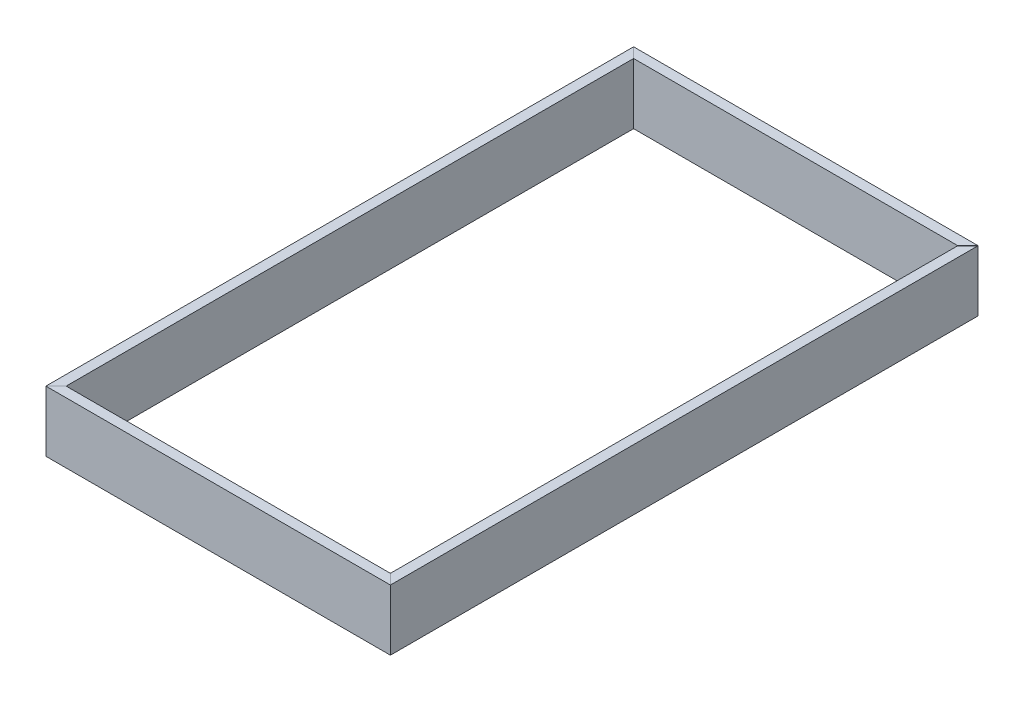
ISO-10303-21;
HEADER;
FILE_DESCRIPTION(('STEP AP214'),'2;1');
FILE_NAME('part.step','',(''),(''),'','','');
FILE_SCHEMA(('AUTOMOTIVE_DESIGN { 1 0 10303 214 1 1 1 1 }'));
ENDSEC;
DATA;
#1=APPLICATION_CONTEXT('core data for automotive mechanical design processes');
#2=APPLICATION_PROTOCOL_DEFINITION('international standard','automotive_design',2000,#1);
#3=PRODUCT_CONTEXT('',#1,'mechanical');
#4=PRODUCT('Part','Part','',(#3));
#5=PRODUCT_RELATED_PRODUCT_CATEGORY('part','',(#4));
#6=PRODUCT_DEFINITION_FORMATION('','',#4);
#7=PRODUCT_DEFINITION_CONTEXT('part definition',#1,'design');
#8=PRODUCT_DEFINITION('design','',#6,#7);
#9=PRODUCT_DEFINITION_SHAPE('','',#8);
#10=(LENGTH_UNIT() NAMED_UNIT(*) SI_UNIT(.MILLI.,.METRE.));
#11=(NAMED_UNIT(*) PLANE_ANGLE_UNIT() SI_UNIT($,.RADIAN.));
#12=(NAMED_UNIT(*) SI_UNIT($,.STERADIAN.) SOLID_ANGLE_UNIT());
#13=UNCERTAINTY_MEASURE_WITH_UNIT(LENGTH_MEASURE(1.E-05),#10,'distance_accuracy_value','');
#14=(GEOMETRIC_REPRESENTATION_CONTEXT(3) GLOBAL_UNCERTAINTY_ASSIGNED_CONTEXT((#13)) GLOBAL_UNIT_ASSIGNED_CONTEXT((#10,
#11,#12)) REPRESENTATION_CONTEXT('',''));
#15=CARTESIAN_POINT('',(0.,0.,0.));
#16=DIRECTION('',(0.,0.,1.));
#17=DIRECTION('',(1.,0.,0.));
#18=AXIS2_PLACEMENT_3D('',#15,#16,#17);
#19=CARTESIAN_POINT('',(0.,0.,88.9));
#20=DIRECTION('',(0.,-1.,0.));
#21=DIRECTION('',(0.,0.,-1.));
#22=AXIS2_PLACEMENT_3D('',#19,#20,#21);
#23=PLANE('',#22);
#24=DIRECTION('',(0.,0.,-1.));
#25=VECTOR('',#24,1.);
#26=CARTESIAN_POINT('',(15.875,0.,-92.075));
#27=LINE('',#26,#25);
#28=CARTESIAN_POINT('',(15.875,0.,92.0390789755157));
#29=VERTEX_POINT('',#28);
#30=CARTESIAN_POINT('',(15.875,0.,-92.0390789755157));
#31=VERTEX_POINT('',#30);
#32=EDGE_CURVE('E108',#29,#31,#27,.T.);
#33=ORIENTED_EDGE('',*,*,#32,.F.);
#34=DIRECTION('',(-0.707106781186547,0.,0.707106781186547));
#35=VECTOR('',#34,1.);
#36=CARTESIAN_POINT('',(19.0320394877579,0.,88.8820394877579));
#37=LINE('',#36,#35);
#38=CARTESIAN_POINT('',(19.05,0.,88.8640789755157));
#39=VERTEX_POINT('',#38);
#40=EDGE_CURVE('E12',#39,#29,#37,.T.);
#41=ORIENTED_EDGE('',*,*,#40,.F.);
#42=DIRECTION('',(0.,0.,-1.));
#43=VECTOR('',#42,1.);
#44=CARTESIAN_POINT('',(19.05,0.,88.9));
#45=LINE('',#44,#43);
#46=CARTESIAN_POINT('',(19.05,0.,-88.8640789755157));
#47=VERTEX_POINT('',#46);
#48=EDGE_CURVE('E93',#39,#47,#45,.T.);
#49=ORIENTED_EDGE('',*,*,#48,.T.);
#50=DIRECTION('',(0.707106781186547,0.,0.707106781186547));
#51=VECTOR('',#50,1.);
#52=CARTESIAN_POINT('',(19.0320394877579,0.,-88.8820394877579));
#53=LINE('',#52,#51);
#54=EDGE_CURVE('E51',#31,#47,#53,.T.);
#55=ORIENTED_EDGE('',*,*,#54,.F.);
#56=EDGE_LOOP('',(#33,#41,#49,#55));
#57=FACE_BOUND('',#56,.T.);
#58=ADVANCED_FACE('F43',(#57),#23,.F.);
#59=CARTESIAN_POINT('',(19.0320394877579,-19.050025,-88.8820394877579));
#60=DIRECTION('',(-0.707106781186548,0.,0.707106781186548));
#61=DIRECTION('',(0.707106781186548,0.,0.707106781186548));
#62=AXIS2_PLACEMENT_3D('',#59,#60,#61);
#63=PLANE('',#62);
#64=DIRECTION('',(0.,-1.,0.));
#65=VECTOR('',#64,1.);
#66=CARTESIAN_POINT('',(15.875,-3.175,-92.0390789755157));
#67=LINE('',#66,#65);
#68=CARTESIAN_POINT('',(15.875,-19.05,-92.0390789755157));
#69=VERTEX_POINT('',#68);
#70=EDGE_CURVE('E87',#31,#69,#67,.T.);
#71=ORIENTED_EDGE('',*,*,#70,.F.);
#72=ORIENTED_EDGE('',*,*,#54,.T.);
#73=DIRECTION('',(0.,1.,0.));
#74=VECTOR('',#73,1.);
#75=CARTESIAN_POINT('',(19.05,0.,-88.8640789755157));
#76=LINE('',#75,#74);
#77=CARTESIAN_POINT('',(19.05,-19.05,-88.8640789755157));
#78=VERTEX_POINT('',#77);
#79=EDGE_CURVE('E84',#78,#47,#76,.T.);
#80=ORIENTED_EDGE('',*,*,#79,.F.);
#81=DIRECTION('',(0.707106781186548,0.,0.707106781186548));
#82=VECTOR('',#81,1.);
#83=CARTESIAN_POINT('',(106.344539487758,-19.05,-1.56953948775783));
#84=LINE('',#83,#82);
#85=EDGE_CURVE('E96',#69,#78,#84,.T.);
#86=ORIENTED_EDGE('',*,*,#85,.F.);
#87=EDGE_LOOP('',(#71,#72,#80,#86));
#88=FACE_BOUND('',#87,.T.);
#89=ADVANCED_FACE('F81',(#88),#63,.F.);
#90=CARTESIAN_POINT('',(19.0320394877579,-19.050025,88.8820394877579));
#91=DIRECTION('',(-0.707106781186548,0.,-0.707106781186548));
#92=DIRECTION('',(-0.707106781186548,0.,0.707106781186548));
#93=AXIS2_PLACEMENT_3D('',#90,#91,#92);
#94=PLANE('',#93);
#95=ORIENTED_EDGE('',*,*,#40,.T.);
#96=DIRECTION('',(0.,1.,0.));
#97=VECTOR('',#96,1.);
#98=CARTESIAN_POINT('',(15.875,-3.175,92.0390789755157));
#99=LINE('',#98,#97);
#100=CARTESIAN_POINT('',(15.875,-19.05,92.0390789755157));
#101=VERTEX_POINT('',#100);
#102=EDGE_CURVE('E95',#101,#29,#99,.T.);
#103=ORIENTED_EDGE('',*,*,#102,.F.);
#104=DIRECTION('',(-0.707106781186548,0.,0.707106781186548));
#105=VECTOR('',#104,1.);
#106=CARTESIAN_POINT('',(17.4445394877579,-19.05,90.4695394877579));
#107=LINE('',#106,#105);
#108=CARTESIAN_POINT('',(19.05,-19.05,88.8640789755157));
#109=VERTEX_POINT('',#108);
#110=EDGE_CURVE('E63',#109,#101,#107,.T.);
#111=ORIENTED_EDGE('',*,*,#110,.F.);
#112=DIRECTION('',(0.,-1.,0.));
#113=VECTOR('',#112,1.);
#114=CARTESIAN_POINT('',(19.05,0.,88.8640789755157));
#115=LINE('',#114,#113);
#116=EDGE_CURVE('E57',#39,#109,#115,.T.);
#117=ORIENTED_EDGE('',*,*,#116,.F.);
#118=EDGE_LOOP('',(#95,#103,#111,#117));
#119=FACE_BOUND('',#118,.T.);
#120=ADVANCED_FACE('F120',(#119),#94,.F.);
#121=CARTESIAN_POINT('',(15.875,-19.05,88.9));
#122=DIRECTION('',(0.,1.,0.));
#123=DIRECTION('',(0.,0.,1.));
#124=AXIS2_PLACEMENT_3D('',#121,#122,#123);
#125=PLANE('',#124);
#126=DIRECTION('',(0.,0.,-1.));
#127=VECTOR('',#126,1.);
#128=CARTESIAN_POINT('',(19.05,-19.05,88.9));
#129=LINE('',#128,#127);
#130=EDGE_CURVE('E100',#109,#78,#129,.T.);
#131=ORIENTED_EDGE('',*,*,#130,.F.);
#132=ORIENTED_EDGE('',*,*,#110,.T.);
#133=DIRECTION('',(0.,0.,-1.));
#134=VECTOR('',#133,1.);
#135=CARTESIAN_POINT('',(15.875,-19.05,88.9));
#136=LINE('',#135,#134);
#137=EDGE_CURVE('E107',#101,#69,#136,.T.);
#138=ORIENTED_EDGE('',*,*,#137,.T.);
#139=ORIENTED_EDGE('',*,*,#85,.T.);
#140=EDGE_LOOP('',(#131,#132,#138,#139));
#141=FACE_BOUND('',#140,.T.);
#142=ADVANCED_FACE('F45',(#141),#125,.F.);
#143=CARTESIAN_POINT('',(15.875,-3.175,88.9));
#144=DIRECTION('',(1.,0.,0.));
#145=DIRECTION('',(0.,0.,-1.));
#146=AXIS2_PLACEMENT_3D('',#143,#144,#145);
#147=PLANE('',#146);
#148=ORIENTED_EDGE('',*,*,#137,.F.);
#149=ORIENTED_EDGE('',*,*,#102,.T.);
#150=ORIENTED_EDGE('',*,*,#32,.T.);
#151=ORIENTED_EDGE('',*,*,#70,.T.);
#152=EDGE_LOOP('',(#148,#149,#150,#151));
#153=FACE_BOUND('',#152,.T.);
#154=ADVANCED_FACE('F117',(#153),#147,.F.);
#155=CARTESIAN_POINT('',(19.05,0.,88.9));
#156=DIRECTION('',(-1.,0.,0.));
#157=DIRECTION('',(0.,0.,1.));
#158=AXIS2_PLACEMENT_3D('',#155,#156,#157);
#159=PLANE('',#158);
#160=ORIENTED_EDGE('',*,*,#48,.F.);
#161=ORIENTED_EDGE('',*,*,#116,.T.);
#162=ORIENTED_EDGE('',*,*,#130,.T.);
#163=ORIENTED_EDGE('',*,*,#79,.T.);
#164=EDGE_LOOP('',(#160,#161,#162,#163));
#165=FACE_BOUND('',#164,.T.);
#166=ADVANCED_FACE('F98',(#165),#159,.F.);
#167=CLOSED_SHELL('',(#58,#89,#120,#142,#154,#166));
#168=MANIFOLD_SOLID_BREP('B2',#167);
#169=CARTESIAN_POINT('',(139.682039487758,-19.050025,107.967960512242));
#170=DIRECTION('',(-0.707106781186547,0.,0.707106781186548));
#171=DIRECTION('',(0.707106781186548,0.,0.707106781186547));
#172=AXIS2_PLACEMENT_3D('',#169,#170,#171);
#173=PLANE('',#172);
#174=DIRECTION('',(0.707106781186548,0.,0.707106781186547));
#175=VECTOR('',#174,1.);
#176=CARTESIAN_POINT('',(139.682039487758,0.,107.967960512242));
#177=LINE('',#176,#175);
#178=CARTESIAN_POINT('',(120.614078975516,0.,88.9));
#179=VERTEX_POINT('',#178);
#180=CARTESIAN_POINT('',(123.789078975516,0.,92.075));
#181=VERTEX_POINT('',#180);
#182=EDGE_CURVE('E219',#179,#181,#177,.T.);
#183=ORIENTED_EDGE('',*,*,#182,.T.);
#184=DIRECTION('',(0.,1.,0.));
#185=VECTOR('',#184,1.);
#186=CARTESIAN_POINT('',(123.789078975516,-127.046681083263,92.075));
#187=LINE('',#186,#185);
#188=CARTESIAN_POINT('',(123.789078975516,-19.05,92.075));
#189=VERTEX_POINT('',#188);
#190=EDGE_CURVE('E247',#189,#181,#187,.T.);
#191=ORIENTED_EDGE('',*,*,#190,.F.);
#192=DIRECTION('',(0.707106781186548,0.,0.707106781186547));
#193=VECTOR('',#192,1.);
#194=CARTESIAN_POINT('',(68.2445394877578,-19.05,36.5304605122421));
#195=LINE('',#194,#193);
#196=CARTESIAN_POINT('',(120.614078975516,-19.05,88.9));
#197=VERTEX_POINT('',#196);
#198=EDGE_CURVE('E269',#197,#189,#195,.T.);
#199=ORIENTED_EDGE('',*,*,#198,.F.);
#200=DIRECTION('',(0.,1.,0.));
#201=VECTOR('',#200,1.);
#202=CARTESIAN_POINT('',(120.614078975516,-144.167881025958,88.9));
#203=LINE('',#202,#201);
#204=EDGE_CURVE('E257',#197,#179,#203,.T.);
#205=ORIENTED_EDGE('',*,*,#204,.T.);
#206=EDGE_LOOP('',(#183,#191,#199,#205));
#207=FACE_BOUND('',#206,.T.);
#208=ADVANCED_FACE('F211',(#207),#173,.F.);
#209=CARTESIAN_POINT('',(0.,0.,88.9));
#210=DIRECTION('',(0.,-1.,0.));
#211=DIRECTION('',(0.,0.,-1.));
#212=AXIS2_PLACEMENT_3D('',#209,#210,#211);
#213=PLANE('',#212);
#214=DIRECTION('',(-1.,0.,0.));
#215=VECTOR('',#214,1.);
#216=CARTESIAN_POINT('',(15.875,0.,92.075));
#217=LINE('',#216,#215);
#218=CARTESIAN_POINT('',(15.9109210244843,0.,92.075));
#219=VERTEX_POINT('',#218);
#220=EDGE_CURVE('E250',#181,#219,#217,.T.);
#221=ORIENTED_EDGE('',*,*,#220,.F.);
#222=ORIENTED_EDGE('',*,*,#182,.F.);
#223=DIRECTION('',(-1.,0.,0.));
#224=VECTOR('',#223,1.);
#225=CARTESIAN_POINT('',(0.,0.,88.9));
#226=LINE('',#225,#224);
#227=CARTESIAN_POINT('',(19.0859210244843,0.,88.9));
#228=VERTEX_POINT('',#227);
#229=EDGE_CURVE('E270',#179,#228,#226,.T.);
#230=ORIENTED_EDGE('',*,*,#229,.T.);
#231=DIRECTION('',(0.707106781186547,0.,-0.707106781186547));
#232=VECTOR('',#231,1.);
#233=CARTESIAN_POINT('',(19.0679605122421,0.,88.9179605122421));
#234=LINE('',#233,#232);
#235=EDGE_CURVE('E264',#219,#228,#234,.T.);
#236=ORIENTED_EDGE('',*,*,#235,.F.);
#237=EDGE_LOOP('',(#221,#222,#230,#236));
#238=FACE_BOUND('',#237,.T.);
#239=ADVANCED_FACE('F261',(#238),#213,.F.);
#240=CARTESIAN_POINT('',(19.0679605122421,-19.050025,88.9179605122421));
#241=DIRECTION('',(0.707106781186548,0.,0.707106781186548));
#242=DIRECTION('',(0.707106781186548,0.,-0.707106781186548));
#243=AXIS2_PLACEMENT_3D('',#240,#241,#242);
#244=PLANE('',#243);
#245=DIRECTION('',(0.,-1.,0.));
#246=VECTOR('',#245,1.);
#247=CARTESIAN_POINT('',(15.9109210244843,-127.046681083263,92.075));
#248=LINE('',#247,#246);
#249=CARTESIAN_POINT('',(15.9109210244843,-19.05,92.075));
#250=VERTEX_POINT('',#249);
#251=EDGE_CURVE('E41',#219,#250,#248,.T.);
#252=ORIENTED_EDGE('',*,*,#251,.F.);
#253=ORIENTED_EDGE('',*,*,#235,.T.);
#254=DIRECTION('',(0.,-1.,0.));
#255=VECTOR('',#254,1.);
#256=CARTESIAN_POINT('',(19.0859210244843,-144.167881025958,88.9));
#257=LINE('',#256,#255);
#258=CARTESIAN_POINT('',(19.0859210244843,-19.05,88.9));
#259=VERTEX_POINT('',#258);
#260=EDGE_CURVE('E271',#228,#259,#257,.T.);
#261=ORIENTED_EDGE('',*,*,#260,.T.);
#262=DIRECTION('',(0.707106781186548,0.,-0.707106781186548));
#263=VECTOR('',#262,1.);
#264=CARTESIAN_POINT('',(17.4804605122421,-19.05,90.5054605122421));
#265=LINE('',#264,#263);
#266=EDGE_CURVE('E229',#250,#259,#265,.T.);
#267=ORIENTED_EDGE('',*,*,#266,.F.);
#268=EDGE_LOOP('',(#252,#253,#261,#267));
#269=FACE_BOUND('',#268,.T.);
#270=ADVANCED_FACE('F281',(#269),#244,.F.);
#271=CARTESIAN_POINT('',(0.,-144.167881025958,88.9));
#272=DIRECTION('',(0.,0.,-1.));
#273=DIRECTION('',(-1.,0.,0.));
#274=AXIS2_PLACEMENT_3D('',#271,#272,#273);
#275=PLANE('',#274);
#276=ORIENTED_EDGE('',*,*,#260,.F.);
#277=ORIENTED_EDGE('',*,*,#229,.F.);
#278=ORIENTED_EDGE('',*,*,#204,.F.);
#279=DIRECTION('',(-1.,0.,0.));
#280=VECTOR('',#279,1.);
#281=CARTESIAN_POINT('',(15.875,-19.05,88.9));
#282=LINE('',#281,#280);
#283=EDGE_CURVE('E274',#197,#259,#282,.T.);
#284=ORIENTED_EDGE('',*,*,#283,.T.);
#285=EDGE_LOOP('',(#276,#277,#278,#284));
#286=FACE_BOUND('',#285,.T.);
#287=ADVANCED_FACE('F283',(#286),#275,.T.);
#288=CARTESIAN_POINT('',(15.875,-127.046681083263,92.075));
#289=DIRECTION('',(0.,0.,-1.));
#290=DIRECTION('',(-1.,0.,0.));
#291=AXIS2_PLACEMENT_3D('',#288,#289,#290);
#292=PLANE('',#291);
#293=ORIENTED_EDGE('',*,*,#190,.T.);
#294=ORIENTED_EDGE('',*,*,#220,.T.);
#295=ORIENTED_EDGE('',*,*,#251,.T.);
#296=DIRECTION('',(1.,0.,0.));
#297=VECTOR('',#296,1.);
#298=CARTESIAN_POINT('',(15.875,-19.05,92.075));
#299=LINE('',#298,#297);
#300=EDGE_CURVE('E253',#250,#189,#299,.T.);
#301=ORIENTED_EDGE('',*,*,#300,.T.);
#302=EDGE_LOOP('',(#293,#294,#295,#301));
#303=FACE_BOUND('',#302,.T.);
#304=ADVANCED_FACE('F249',(#303),#292,.F.);
#305=CARTESIAN_POINT('',(15.875,-19.05,88.9));
#306=DIRECTION('',(0.,1.,0.));
#307=DIRECTION('',(0.,0.,1.));
#308=AXIS2_PLACEMENT_3D('',#305,#306,#307);
#309=PLANE('',#308);
#310=ORIENTED_EDGE('',*,*,#300,.F.);
#311=ORIENTED_EDGE('',*,*,#266,.T.);
#312=ORIENTED_EDGE('',*,*,#283,.F.);
#313=ORIENTED_EDGE('',*,*,#198,.T.);
#314=EDGE_LOOP('',(#310,#311,#312,#313));
#315=FACE_BOUND('',#314,.T.);
#316=ADVANCED_FACE('F213',(#315),#309,.F.);
#317=CLOSED_SHELL('',(#208,#239,#270,#287,#304,#316));
#318=MANIFOLD_SOLID_BREP('B6',#317);
#319=CARTESIAN_POINT('',(120.667960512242,-19.050025,-88.8820394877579));
#320=DIRECTION('',(0.707106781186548,0.,0.707106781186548));
#321=DIRECTION('',(0.707106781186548,0.,-0.707106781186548));
#322=AXIS2_PLACEMENT_3D('',#319,#320,#321);
#323=PLANE('',#322);
#324=DIRECTION('',(0.707106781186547,0.,-0.707106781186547));
#325=VECTOR('',#324,1.);
#326=CARTESIAN_POINT('',(120.667960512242,0.,-88.8820394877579));
#327=LINE('',#326,#325);
#328=CARTESIAN_POINT('',(120.65,0.,-88.8640789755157));
#329=VERTEX_POINT('',#328);
#330=CARTESIAN_POINT('',(123.825,0.,-92.0390789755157));
#331=VERTEX_POINT('',#330);
#332=EDGE_CURVE('E381',#329,#331,#327,.T.);
#333=ORIENTED_EDGE('',*,*,#332,.T.);
#334=DIRECTION('',(0.,1.,0.));
#335=VECTOR('',#334,1.);
#336=CARTESIAN_POINT('',(123.825,-3.1749999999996,-92.0390789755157));
#337=LINE('',#336,#335);
#338=CARTESIAN_POINT('',(123.825,-19.05,-92.0390789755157));
#339=VERTEX_POINT('',#338);
#340=EDGE_CURVE('E409',#339,#331,#337,.T.);
#341=ORIENTED_EDGE('',*,*,#340,.F.);
#342=DIRECTION('',(0.707106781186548,0.,-0.707106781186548));
#343=VECTOR('',#342,1.);
#344=CARTESIAN_POINT('',(-20.6195394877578,-19.05,52.4054605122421));
#345=LINE('',#344,#343);
#346=CARTESIAN_POINT('',(120.65,-19.05,-88.8640789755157));
#347=VERTEX_POINT('',#346);
#348=EDGE_CURVE('E430',#347,#339,#345,.T.);
#349=ORIENTED_EDGE('',*,*,#348,.F.);
#350=DIRECTION('',(0.,-1.,0.));
#351=VECTOR('',#350,1.);
#352=CARTESIAN_POINT('',(120.65,3.33014570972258E-13,-88.8640789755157));
#353=LINE('',#352,#351);
#354=EDGE_CURVE('E428',#329,#347,#353,.T.);
#355=ORIENTED_EDGE('',*,*,#354,.F.);
#356=EDGE_LOOP('',(#333,#341,#349,#355));
#357=FACE_BOUND('',#356,.T.);
#358=ADVANCED_FACE('F373',(#357),#323,.F.);
#359=CARTESIAN_POINT('',(0.,0.,88.9));
#360=DIRECTION('',(0.,-1.,0.));
#361=DIRECTION('',(0.,0.,-1.));
#362=AXIS2_PLACEMENT_3D('',#359,#360,#361);
#363=PLANE('',#362);
#364=DIRECTION('',(0.,0.,1.));
#365=VECTOR('',#364,1.);
#366=CARTESIAN_POINT('',(123.825,0.,-92.075));
#367=LINE('',#366,#365);
#368=CARTESIAN_POINT('',(123.825,0.,92.0390789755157));
#369=VERTEX_POINT('',#368);
#370=EDGE_CURVE('E412',#331,#369,#367,.T.);
#371=ORIENTED_EDGE('',*,*,#370,.F.);
#372=ORIENTED_EDGE('',*,*,#332,.F.);
#373=DIRECTION('',(0.,0.,-1.));
#374=VECTOR('',#373,1.);
#375=CARTESIAN_POINT('',(120.65,0.,88.9));
#376=LINE('',#375,#374);
#377=CARTESIAN_POINT('',(120.65,0.,88.8640789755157));
#378=VERTEX_POINT('',#377);
#379=EDGE_CURVE('E432',#378,#329,#376,.T.);
#380=ORIENTED_EDGE('',*,*,#379,.F.);
#381=DIRECTION('',(-0.707106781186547,0.,-0.707106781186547));
#382=VECTOR('',#381,1.);
#383=CARTESIAN_POINT('',(120.667960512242,0.,88.8820394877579));
#384=LINE('',#383,#382);
#385=EDGE_CURVE('E424',#369,#378,#384,.T.);
#386=ORIENTED_EDGE('',*,*,#385,.F.);
#387=EDGE_LOOP('',(#371,#372,#380,#386));
#388=FACE_BOUND('',#387,.T.);
#389=ADVANCED_FACE('F375',(#388),#363,.F.);
#390=CARTESIAN_POINT('',(120.667960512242,-19.050025,88.8820394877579));
#391=DIRECTION('',(0.707106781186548,0.,-0.707106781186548));
#392=DIRECTION('',(-0.707106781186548,0.,-0.707106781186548));
#393=AXIS2_PLACEMENT_3D('',#390,#391,#392);
#394=PLANE('',#393);
#395=DIRECTION('',(0.,-1.,0.));
#396=VECTOR('',#395,1.);
#397=CARTESIAN_POINT('',(123.825,-3.17499999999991,92.0390789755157));
#398=LINE('',#397,#396);
#399=CARTESIAN_POINT('',(123.825,-19.0499999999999,92.0390789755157));
#400=VERTEX_POINT('',#399);
#401=EDGE_CURVE('E209',#369,#400,#398,.T.);
#402=ORIENTED_EDGE('',*,*,#401,.F.);
#403=ORIENTED_EDGE('',*,*,#385,.T.);
#404=DIRECTION('',(0.,1.,0.));
#405=VECTOR('',#404,1.);
#406=CARTESIAN_POINT('',(120.65,0.,88.8640789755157));
#407=LINE('',#406,#405);
#408=CARTESIAN_POINT('',(120.65,-19.05,88.8640789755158));
#409=VERTEX_POINT('',#408);
#410=EDGE_CURVE('E437',#409,#378,#407,.T.);
#411=ORIENTED_EDGE('',*,*,#410,.F.);
#412=DIRECTION('',(-0.707106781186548,0.,-0.707106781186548));
#413=VECTOR('',#412,1.);
#414=CARTESIAN_POINT('',(68.2804605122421,-19.05,36.4945394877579));
#415=LINE('',#414,#413);
#416=EDGE_CURVE('E391',#400,#409,#415,.T.);
#417=ORIENTED_EDGE('',*,*,#416,.F.);
#418=EDGE_LOOP('',(#402,#403,#411,#417));
#419=FACE_BOUND('',#418,.T.);
#420=ADVANCED_FACE('F442',(#419),#394,.F.);
#421=CARTESIAN_POINT('',(120.65,0.,88.9));
#422=DIRECTION('',(1.,0.,0.));
#423=DIRECTION('',(0.,1.,0.));
#424=AXIS2_PLACEMENT_3D('',#421,#422,#423);
#425=PLANE('',#424);
#426=DIRECTION('',(0.,0.,-1.));
#427=VECTOR('',#426,1.);
#428=CARTESIAN_POINT('',(120.65,-19.0499999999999,88.9));
#429=LINE('',#428,#427);
#430=EDGE_CURVE('E433',#409,#347,#429,.T.);
#431=ORIENTED_EDGE('',*,*,#430,.F.);
#432=ORIENTED_EDGE('',*,*,#410,.T.);
#433=ORIENTED_EDGE('',*,*,#379,.T.);
#434=ORIENTED_EDGE('',*,*,#354,.T.);
#435=EDGE_LOOP('',(#431,#432,#433,#434));
#436=FACE_BOUND('',#435,.T.);
#437=ADVANCED_FACE('F445',(#436),#425,.F.);
#438=CARTESIAN_POINT('',(123.825,-3.17499999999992,88.9));
#439=DIRECTION('',(-1.,0.,0.));
#440=DIRECTION('',(0.,-1.,0.));
#441=AXIS2_PLACEMENT_3D('',#438,#439,#440);
#442=PLANE('',#441);
#443=ORIENTED_EDGE('',*,*,#340,.T.);
#444=ORIENTED_EDGE('',*,*,#370,.T.);
#445=ORIENTED_EDGE('',*,*,#401,.T.);
#446=DIRECTION('',(0.,0.,-1.));
#447=VECTOR('',#446,1.);
#448=CARTESIAN_POINT('',(123.825,-19.0499999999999,88.9));
#449=LINE('',#448,#447);
#450=EDGE_CURVE('E415',#400,#339,#449,.T.);
#451=ORIENTED_EDGE('',*,*,#450,.T.);
#452=EDGE_LOOP('',(#443,#444,#445,#451));
#453=FACE_BOUND('',#452,.T.);
#454=ADVANCED_FACE('F411',(#453),#442,.F.);
#455=CARTESIAN_POINT('',(15.875,-19.05,88.9));
#456=DIRECTION('',(0.,1.,0.));
#457=DIRECTION('',(0.,0.,1.));
#458=AXIS2_PLACEMENT_3D('',#455,#456,#457);
#459=PLANE('',#458);
#460=ORIENTED_EDGE('',*,*,#450,.F.);
#461=ORIENTED_EDGE('',*,*,#416,.T.);
#462=ORIENTED_EDGE('',*,*,#430,.T.);
#463=ORIENTED_EDGE('',*,*,#348,.T.);
#464=EDGE_LOOP('',(#460,#461,#462,#463));
#465=FACE_BOUND('',#464,.T.);
#466=ADVANCED_FACE('F447',(#465),#459,.F.);
#467=CLOSED_SHELL('',(#358,#389,#420,#437,#454,#466));
#468=MANIFOLD_SOLID_BREP('B35',#467);
#469=CARTESIAN_POINT('',(0.0179605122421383,-19.050025,-107.967960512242));
#470=DIRECTION('',(0.707106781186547,0.,-0.707106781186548));
#471=DIRECTION('',(-0.707106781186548,0.,-0.707106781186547));
#472=AXIS2_PLACEMENT_3D('',#469,#470,#471);
#473=PLANE('',#472);
#474=DIRECTION('',(-0.707106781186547,0.,-0.707106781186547));
#475=VECTOR('',#474,1.);
#476=CARTESIAN_POINT('',(0.0179605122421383,0.,-107.967960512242));
#477=LINE('',#476,#475);
#478=CARTESIAN_POINT('',(19.0859210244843,0.,-88.9));
#479=VERTEX_POINT('',#478);
#480=CARTESIAN_POINT('',(15.9109210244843,0.,-92.075));
#481=VERTEX_POINT('',#480);
#482=EDGE_CURVE('E580',#479,#481,#477,.T.);
#483=ORIENTED_EDGE('',*,*,#482,.T.);
#484=DIRECTION('',(0.,1.,0.));
#485=VECTOR('',#484,1.);
#486=CARTESIAN_POINT('',(15.9109210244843,-127.046681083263,-92.075));
#487=LINE('',#486,#485);
#488=CARTESIAN_POINT('',(15.9109210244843,-19.05,-92.075));
#489=VERTEX_POINT('',#488);
#490=EDGE_CURVE('E537',#489,#481,#487,.T.);
#491=ORIENTED_EDGE('',*,*,#490,.F.);
#492=DIRECTION('',(-0.707106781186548,0.,-0.707106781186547));
#493=VECTOR('',#492,1.);
#494=CARTESIAN_POINT('',(106.380460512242,-19.05,-1.60546051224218));
#495=LINE('',#494,#493);
#496=CARTESIAN_POINT('',(19.0859210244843,-19.05,-88.9));
#497=VERTEX_POINT('',#496);
#498=EDGE_CURVE('E586',#497,#489,#495,.T.);
#499=ORIENTED_EDGE('',*,*,#498,.F.);
#500=DIRECTION('',(0.,1.,0.));
#501=VECTOR('',#500,1.);
#502=CARTESIAN_POINT('',(19.0859210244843,-144.167881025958,-88.9));
#503=LINE('',#502,#501);
#504=EDGE_CURVE('E585',#497,#479,#503,.T.);
#505=ORIENTED_EDGE('',*,*,#504,.T.);
#506=EDGE_LOOP('',(#483,#491,#499,#505));
#507=FACE_BOUND('',#506,.T.);
#508=ADVANCED_FACE('F529',(#507),#473,.F.);
#509=CARTESIAN_POINT('',(0.,0.,88.9));
#510=DIRECTION('',(0.,-1.,0.));
#511=DIRECTION('',(0.,0.,-1.));
#512=AXIS2_PLACEMENT_3D('',#509,#510,#511);
#513=PLANE('',#512);
#514=DIRECTION('',(1.,0.,0.));
#515=VECTOR('',#514,1.);
#516=CARTESIAN_POINT('',(15.875,0.,-92.075));
#517=LINE('',#516,#515);
#518=CARTESIAN_POINT('',(123.789078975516,0.,-92.075));
#519=VERTEX_POINT('',#518);
#520=EDGE_CURVE('E567',#481,#519,#517,.T.);
#521=ORIENTED_EDGE('',*,*,#520,.F.);
#522=ORIENTED_EDGE('',*,*,#482,.F.);
#523=DIRECTION('',(1.,0.,0.));
#524=VECTOR('',#523,1.);
#525=CARTESIAN_POINT('',(0.,0.,-88.9));
#526=LINE('',#525,#524);
#527=CARTESIAN_POINT('',(120.614078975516,0.,-88.9));
#528=VERTEX_POINT('',#527);
#529=EDGE_CURVE('E574',#479,#528,#526,.T.);
#530=ORIENTED_EDGE('',*,*,#529,.T.);
#531=DIRECTION('',(-0.707106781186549,0.,0.707106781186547));
#532=VECTOR('',#531,1.);
#533=CARTESIAN_POINT('',(120.632039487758,0.,-88.9179605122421));
#534=LINE('',#533,#532);
#535=EDGE_CURVE('E582',#519,#528,#534,.T.);
#536=ORIENTED_EDGE('',*,*,#535,.F.);
#537=EDGE_LOOP('',(#521,#522,#530,#536));
#538=FACE_BOUND('',#537,.T.);
#539=ADVANCED_FACE('F578',(#538),#513,.F.);
#540=CARTESIAN_POINT('',(120.632039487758,-19.050025,-88.9179605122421));
#541=DIRECTION('',(-0.707106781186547,0.,-0.707106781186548));
#542=DIRECTION('',(-0.707106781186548,0.,0.707106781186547));
#543=AXIS2_PLACEMENT_3D('',#540,#541,#542);
#544=PLANE('',#543);
#545=DIRECTION('',(0.,-1.,0.));
#546=VECTOR('',#545,1.);
#547=CARTESIAN_POINT('',(123.789078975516,-127.046681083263,-92.075));
#548=LINE('',#547,#546);
#549=CARTESIAN_POINT('',(123.789078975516,-19.05,-92.075));
#550=VERTEX_POINT('',#549);
#551=EDGE_CURVE('E371',#519,#550,#548,.T.);
#552=ORIENTED_EDGE('',*,*,#551,.F.);
#553=ORIENTED_EDGE('',*,*,#535,.T.);
#554=DIRECTION('',(0.,-1.,0.));
#555=VECTOR('',#554,1.);
#556=CARTESIAN_POINT('',(120.614078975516,-144.167881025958,-88.9));
#557=LINE('',#556,#555);
#558=CARTESIAN_POINT('',(120.614078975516,-19.05,-88.9));
#559=VERTEX_POINT('',#558);
#560=EDGE_CURVE('E587',#528,#559,#557,.T.);
#561=ORIENTED_EDGE('',*,*,#560,.T.);
#562=DIRECTION('',(-0.707106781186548,0.,0.707106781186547));
#563=VECTOR('',#562,1.);
#564=CARTESIAN_POINT('',(-20.6554605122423,-19.05,52.3695394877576));
#565=LINE('',#564,#563);
#566=EDGE_CURVE('E547',#550,#559,#565,.T.);
#567=ORIENTED_EDGE('',*,*,#566,.F.);
#568=EDGE_LOOP('',(#552,#553,#561,#567));
#569=FACE_BOUND('',#568,.T.);
#570=ADVANCED_FACE('F603',(#569),#544,.F.);
#571=CARTESIAN_POINT('',(15.875,-127.046681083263,-92.075));
#572=DIRECTION('',(0.,0.,1.));
#573=DIRECTION('',(1.,0.,0.));
#574=AXIS2_PLACEMENT_3D('',#571,#572,#573);
#575=PLANE('',#574);
#576=ORIENTED_EDGE('',*,*,#490,.T.);
#577=ORIENTED_EDGE('',*,*,#520,.T.);
#578=ORIENTED_EDGE('',*,*,#551,.T.);
#579=DIRECTION('',(-1.,0.,0.));
#580=VECTOR('',#579,1.);
#581=CARTESIAN_POINT('',(15.875,-19.05,-92.075));
#582=LINE('',#581,#580);
#583=EDGE_CURVE('E570',#550,#489,#582,.T.);
#584=ORIENTED_EDGE('',*,*,#583,.T.);
#585=EDGE_LOOP('',(#576,#577,#578,#584));
#586=FACE_BOUND('',#585,.T.);
#587=ADVANCED_FACE('F566',(#586),#575,.F.);
#588=CARTESIAN_POINT('',(15.875,-19.05,88.9));
#589=DIRECTION('',(0.,1.,0.));
#590=DIRECTION('',(0.,0.,1.));
#591=AXIS2_PLACEMENT_3D('',#588,#589,#590);
#592=PLANE('',#591);
#593=ORIENTED_EDGE('',*,*,#583,.F.);
#594=ORIENTED_EDGE('',*,*,#566,.T.);
#595=DIRECTION('',(1.,0.,0.));
#596=VECTOR('',#595,1.);
#597=CARTESIAN_POINT('',(15.875,-19.05,-88.9));
#598=LINE('',#597,#596);
#599=EDGE_CURVE('E594',#497,#559,#598,.T.);
#600=ORIENTED_EDGE('',*,*,#599,.F.);
#601=ORIENTED_EDGE('',*,*,#498,.T.);
#602=EDGE_LOOP('',(#593,#594,#600,#601));
#603=FACE_BOUND('',#602,.T.);
#604=ADVANCED_FACE('F531',(#603),#592,.F.);
#605=CARTESIAN_POINT('',(0.,-144.167881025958,-88.9));
#606=DIRECTION('',(0.,0.,1.));
#607=DIRECTION('',(1.,0.,0.));
#608=AXIS2_PLACEMENT_3D('',#605,#606,#607);
#609=PLANE('',#608);
#610=ORIENTED_EDGE('',*,*,#560,.F.);
#611=ORIENTED_EDGE('',*,*,#529,.F.);
#612=ORIENTED_EDGE('',*,*,#504,.F.);
#613=ORIENTED_EDGE('',*,*,#599,.T.);
#614=EDGE_LOOP('',(#610,#611,#612,#613));
#615=FACE_BOUND('',#614,.T.);
#616=ADVANCED_FACE('F601',(#615),#609,.T.);
#617=CLOSED_SHELL('',(#508,#539,#570,#587,#604,#616));
#618=MANIFOLD_SOLID_BREP('B203',#617);
#619=ADVANCED_BREP_SHAPE_REPRESENTATION('',(#18,#168,#318,#468,#618),#14);
#620=SHAPE_DEFINITION_REPRESENTATION(#9,#619);
ENDSEC;
END-ISO-10303-21;
